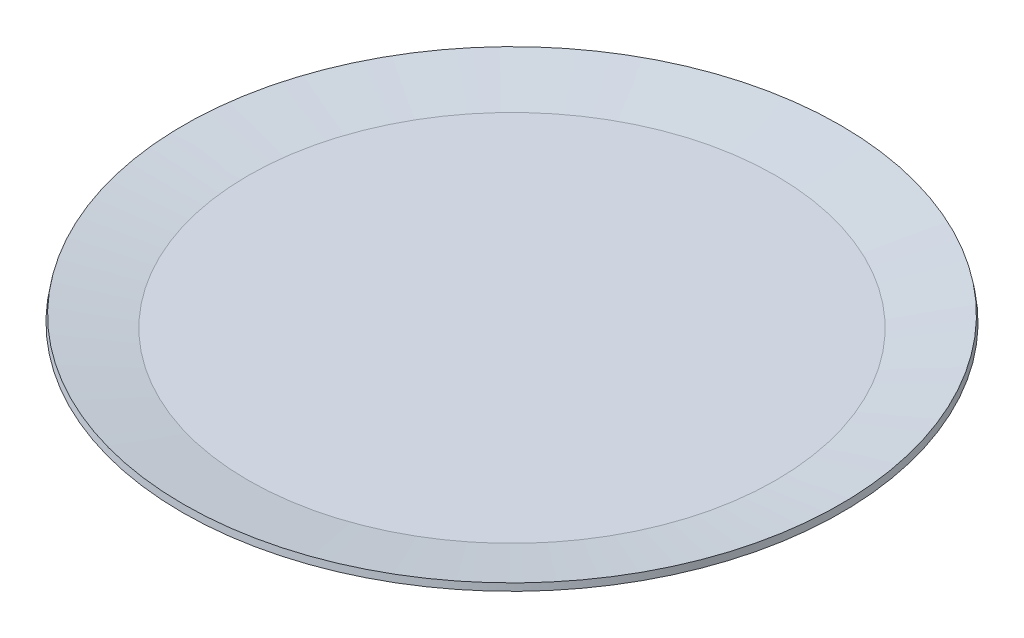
ISO-10303-21;
HEADER;
FILE_DESCRIPTION(('STEP AP214'),'2;1');
FILE_NAME('part.step','',(''),(''),'','','');
FILE_SCHEMA(('AUTOMOTIVE_DESIGN { 1 0 10303 214 1 1 1 1 }'));
ENDSEC;
DATA;
#1=APPLICATION_CONTEXT('core data for automotive mechanical design processes');
#2=APPLICATION_PROTOCOL_DEFINITION('international standard','automotive_design',2000,#1);
#3=PRODUCT_CONTEXT('',#1,'mechanical');
#4=PRODUCT('Part','Part','',(#3));
#5=PRODUCT_RELATED_PRODUCT_CATEGORY('part','',(#4));
#6=PRODUCT_DEFINITION_FORMATION('','',#4);
#7=PRODUCT_DEFINITION_CONTEXT('part definition',#1,'design');
#8=PRODUCT_DEFINITION('design','',#6,#7);
#9=PRODUCT_DEFINITION_SHAPE('','',#8);
#10=(LENGTH_UNIT() NAMED_UNIT(*) SI_UNIT(.MILLI.,.METRE.));
#11=(NAMED_UNIT(*) PLANE_ANGLE_UNIT() SI_UNIT($,.RADIAN.));
#12=(NAMED_UNIT(*) SI_UNIT($,.STERADIAN.) SOLID_ANGLE_UNIT());
#13=UNCERTAINTY_MEASURE_WITH_UNIT(LENGTH_MEASURE(1.E-05),#10,'distance_accuracy_value','');
#14=(GEOMETRIC_REPRESENTATION_CONTEXT(3) GLOBAL_UNCERTAINTY_ASSIGNED_CONTEXT((#13)) GLOBAL_UNIT_ASSIGNED_CONTEXT((#10,
#11,#12)) REPRESENTATION_CONTEXT('',''));
#15=CARTESIAN_POINT('',(0.,0.,0.));
#16=DIRECTION('',(0.,0.,1.));
#17=DIRECTION('',(1.,0.,0.));
#18=AXIS2_PLACEMENT_3D('',#15,#16,#17);
#19=CARTESIAN_POINT('',(0.,1.,0.));
#20=DIRECTION('',(0.,1.,0.));
#21=DIRECTION('',(0.,0.,1.));
#22=AXIS2_PLACEMENT_3D('',#19,#20,#21);
#23=TOROIDAL_SURFACE('',#22,39.9125113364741,1.);
#24=CARTESIAN_POINT('',(0.,0.,0.));
#25=DIRECTION('',(0.,1.,0.));
#26=DIRECTION('',(0.,0.,1.));
#27=AXIS2_PLACEMENT_3D('',#24,#25,#26);
#28=CIRCLE('',#27,39.9125113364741);
#29=CARTESIAN_POINT('',(0.,0.,39.9125113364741));
#30=VERTEX_POINT('',#29);
#31=EDGE_CURVE('E50',#30,#30,#28,.T.);
#32=ORIENTED_EDGE('',*,*,#31,.T.);
#33=EDGE_LOOP('',(#32));
#34=FACE_BOUND('',#33,.T.);
#35=CARTESIAN_POINT('',(0.,0.0151922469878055,0.));
#36=DIRECTION('',(0.,1.,0.));
#37=DIRECTION('',(0.,0.,1.));
#38=AXIS2_PLACEMENT_3D('',#35,#36,#37);
#39=CIRCLE('',#38,40.086159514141);
#40=CARTESIAN_POINT('',(0.,0.0151922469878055,40.086159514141));
#41=VERTEX_POINT('',#40);
#42=EDGE_CURVE('E10',#41,#41,#39,.T.);
#43=ORIENTED_EDGE('',*,*,#42,.F.);
#44=EDGE_LOOP('',(#43));
#45=FACE_BOUND('',#44,.T.);
#46=ADVANCED_FACE('F31',(#34,#45),#23,.T.);
#47=CARTESIAN_POINT('',(0.,0.0151922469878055,0.));
#48=DIRECTION('',(0.,1.,0.));
#49=DIRECTION('',(0.,0.,1.));
#50=AXIS2_PLACEMENT_3D('',#47,#48,#49);
#51=CONICAL_SURFACE('',#50,40.086159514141,1.39626340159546);
#52=CARTESIAN_POINT('',(0.,1.73648177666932,0.));
#53=DIRECTION('',(0.,1.,0.));
#54=DIRECTION('',(0.,0.,1.));
#55=AXIS2_PLACEMENT_3D('',#52,#53,#54);
#56=CIRCLE('',#55,49.8480775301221);
#57=CARTESIAN_POINT('',(0.,1.73648177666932,49.8480775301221));
#58=VERTEX_POINT('',#57);
#59=EDGE_CURVE('E37',#58,#58,#56,.T.);
#60=ORIENTED_EDGE('',*,*,#59,.F.);
#61=EDGE_LOOP('',(#60));
#62=FACE_BOUND('',#61,.T.);
#63=ORIENTED_EDGE('',*,*,#42,.T.);
#64=EDGE_LOOP('',(#63));
#65=FACE_BOUND('',#64,.T.);
#66=ADVANCED_FACE('F67',(#62,#65),#51,.T.);
#67=CARTESIAN_POINT('',(0.,2.72128952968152,0.));
#68=DIRECTION('',(0.,-1.,0.));
#69=DIRECTION('',(0.,0.,-1.));
#70=AXIS2_PLACEMENT_3D('',#67,#68,#69);
#71=CONICAL_SURFACE('',#70,49.6744293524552,0.174532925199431);
#72=ORIENTED_EDGE('',*,*,#59,.T.);
#73=EDGE_LOOP('',(#72));
#74=FACE_BOUND('',#73,.T.);
#75=CARTESIAN_POINT('',(0.,2.72128952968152,0.));
#76=DIRECTION('',(0.,1.,0.));
#77=DIRECTION('',(0.,0.,1.));
#78=AXIS2_PLACEMENT_3D('',#75,#76,#77);
#79=CIRCLE('',#78,49.6744293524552);
#80=CARTESIAN_POINT('',(0.,2.72128952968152,49.6744293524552));
#81=VERTEX_POINT('',#80);
#82=EDGE_CURVE('E41',#81,#81,#79,.T.);
#83=ORIENTED_EDGE('',*,*,#82,.F.);
#84=EDGE_LOOP('',(#83));
#85=FACE_BOUND('',#84,.T.);
#86=ADVANCED_FACE('F71',(#74,#85),#71,.T.);
#87=CARTESIAN_POINT('',(0.,1.,0.));
#88=DIRECTION('',(0.,1.,0.));
#89=DIRECTION('',(0.,0.,1.));
#90=AXIS2_PLACEMENT_3D('',#87,#88,#89);
#91=CONICAL_SURFACE('',#90,39.9125113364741,1.39626340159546);
#92=ORIENTED_EDGE('',*,*,#82,.T.);
#93=EDGE_LOOP('',(#92));
#94=FACE_BOUND('',#93,.T.);
#95=CARTESIAN_POINT('',(0.,1.,0.));
#96=DIRECTION('',(0.,1.,0.));
#97=DIRECTION('',(0.,0.,1.));
#98=AXIS2_PLACEMENT_3D('',#95,#96,#97);
#99=CIRCLE('',#98,39.9125113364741);
#100=CARTESIAN_POINT('',(0.,1.,39.9125113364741));
#101=VERTEX_POINT('',#100);
#102=EDGE_CURVE('E45',#101,#101,#99,.T.);
#103=ORIENTED_EDGE('',*,*,#102,.F.);
#104=EDGE_LOOP('',(#103));
#105=FACE_BOUND('',#104,.T.);
#106=ADVANCED_FACE('F63',(#94,#105),#91,.F.);
#107=CARTESIAN_POINT('',(24.924038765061,1.,0.));
#108=DIRECTION('',(0.,1.,0.));
#109=DIRECTION('',(0.,0.,1.));
#110=AXIS2_PLACEMENT_3D('',#107,#108,#109);
#111=PLANE('',#110);
#112=ORIENTED_EDGE('',*,*,#102,.T.);
#113=EDGE_LOOP('',(#112));
#114=FACE_BOUND('',#113,.T.);
#115=ADVANCED_FACE('F58',(#114),#111,.T.);
#116=CARTESIAN_POINT('',(24.924038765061,0.,0.));
#117=DIRECTION('',(0.,1.,0.));
#118=DIRECTION('',(0.,0.,1.));
#119=AXIS2_PLACEMENT_3D('',#116,#117,#118);
#120=PLANE('',#119);
#121=ORIENTED_EDGE('',*,*,#31,.F.);
#122=EDGE_LOOP('',(#121));
#123=FACE_BOUND('',#122,.T.);
#124=ADVANCED_FACE('F56',(#123),#120,.F.);
#125=CLOSED_SHELL('',(#46,#66,#86,#106,#115,#124));
#126=MANIFOLD_SOLID_BREP('B2',#125);
#127=ADVANCED_BREP_SHAPE_REPRESENTATION('',(#18,#126),#14);
#128=SHAPE_DEFINITION_REPRESENTATION(#9,#127);
ENDSEC;
END-ISO-10303-21;
